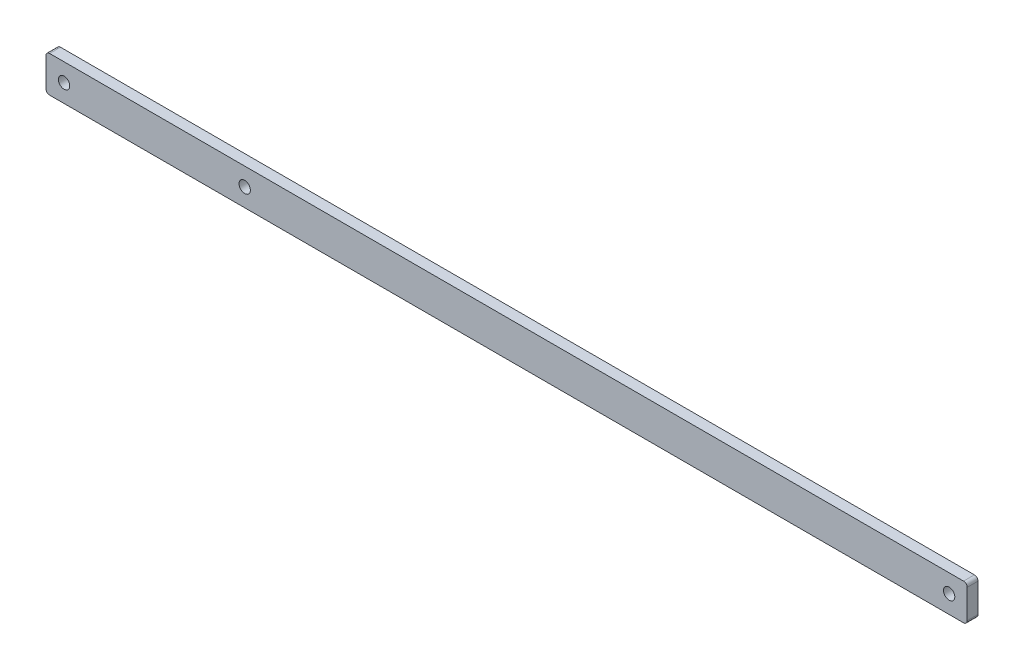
from build123d import *

# Parameters (mm, degrees)
SKETCH1_W           = 647.7
SKETCH1_H           = 25.4
BOSS_EXTRUDE1_DEPTH = 7.62
SKETCH2_R           = 4
CUT_EXTRUDE1_DEPTH  = 649.242635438
FILLET1_R           = 2.54
SKETCH3_R           = 4
CUT_EXTRUDE2_DEPTH  = 649.242635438


with BuildPart() as part:
    # Sketch1 → Boss-Extrude1 (new body)
    with BuildSketch(Plane.XY):
        with Locations((323.85, 12.7)):
            Rectangle(SKETCH1_W, SKETCH1_H)
    extrude(amount=BOSS_EXTRUDE1_DEPTH)

    # Sketch2 → Cut-Extrude1 (cut, through all)
    with BuildSketch(Plane.XY.offset(7.62)):
        with Locations((12.7, 12.7)):
            Circle(SKETCH2_R)
    cut_extrude1 = extrude(amount=-CUT_EXTRUDE1_DEPTH, mode=Mode.SUBTRACT)

    # Mirror1: Cut-Extrude1 across plane
    add(cut_extrude1.mirror(Plane(origin=(323.85, 0, 0), x_dir=(0, 0, 1), z_dir=(1, 0, 0))), mode=Mode.SUBTRACT)

    # Fillet1
    fillet1_edges = [part.edges().sort_by_distance(p)[0] for p in [
        (0, 25.4, 3.81),
        (647.7, 25.4, 3.81),
        (647.7, 0, 3.81),
        (0, 0, 3.81),
    ]]
    fillet(fillet1_edges, radius=FILLET1_R)

    # Sketch3 → Cut-Extrude2 (cut, through all)
    with BuildSketch(Plane.XY.offset(7.62)):
        with Locations((139.7, 12.7)):
            Circle(SKETCH3_R)
    extrude(amount=-CUT_EXTRUDE2_DEPTH, mode=Mode.SUBTRACT)


solid = part.part
